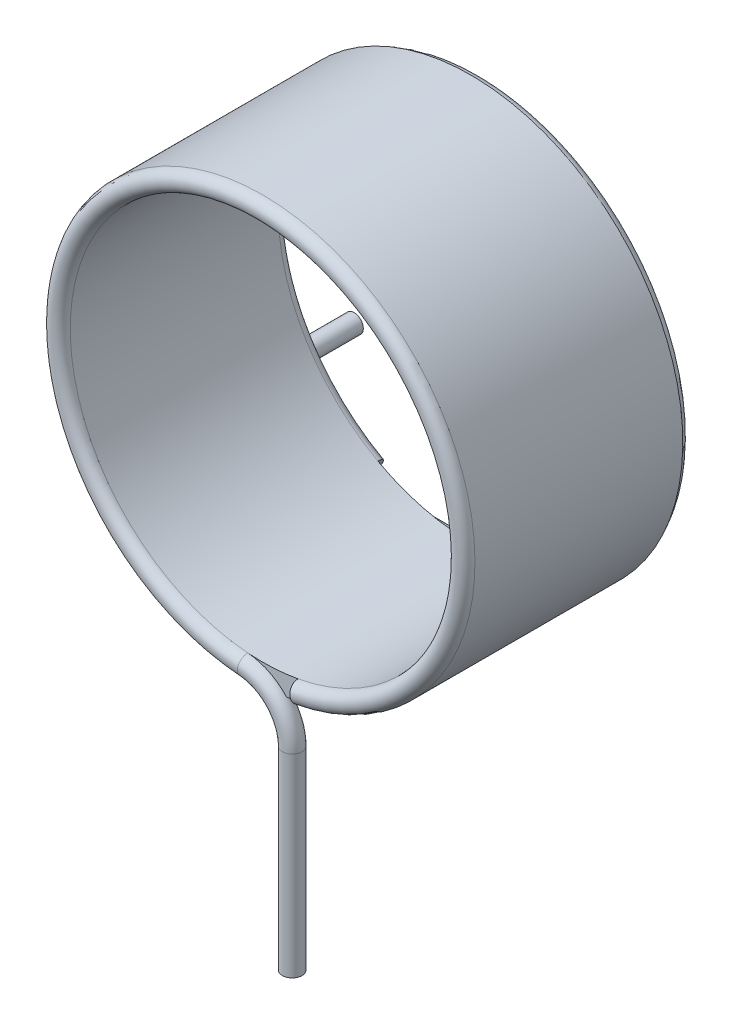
ISO-10303-21;
HEADER;
FILE_DESCRIPTION(('STEP AP214'),'2;1');
FILE_NAME('part.step','',(''),(''),'','','');
FILE_SCHEMA(('AUTOMOTIVE_DESIGN { 1 0 10303 214 1 1 1 1 }'));
ENDSEC;
DATA;
#1=APPLICATION_CONTEXT('core data for automotive mechanical design processes');
#2=APPLICATION_PROTOCOL_DEFINITION('international standard','automotive_design',2000,#1);
#3=PRODUCT_CONTEXT('',#1,'mechanical');
#4=PRODUCT('Part','Part','',(#3));
#5=PRODUCT_RELATED_PRODUCT_CATEGORY('part','',(#4));
#6=PRODUCT_DEFINITION_FORMATION('','',#4);
#7=PRODUCT_DEFINITION_CONTEXT('part definition',#1,'design');
#8=PRODUCT_DEFINITION('design','',#6,#7);
#9=PRODUCT_DEFINITION_SHAPE('','',#8);
#10=(LENGTH_UNIT() NAMED_UNIT(*) SI_UNIT(.MILLI.,.METRE.));
#11=(NAMED_UNIT(*) PLANE_ANGLE_UNIT() SI_UNIT($,.RADIAN.));
#12=(NAMED_UNIT(*) SI_UNIT($,.STERADIAN.) SOLID_ANGLE_UNIT());
#13=UNCERTAINTY_MEASURE_WITH_UNIT(LENGTH_MEASURE(1.E-05),#10,'distance_accuracy_value','');
#14=(GEOMETRIC_REPRESENTATION_CONTEXT(3) GLOBAL_UNCERTAINTY_ASSIGNED_CONTEXT((#13)) GLOBAL_UNIT_ASSIGNED_CONTEXT((#10,
#11,#12)) REPRESENTATION_CONTEXT('',''));
#15=CARTESIAN_POINT('',(0.,0.,0.));
#16=DIRECTION('',(0.,0.,1.));
#17=DIRECTION('',(1.,0.,0.));
#18=AXIS2_PLACEMENT_3D('',#15,#16,#17);
#19=CARTESIAN_POINT('',(0.,0.,0.));
#20=DIRECTION('',(0.,0.,1.));
#21=DIRECTION('',(1.,0.,0.));
#22=AXIS2_PLACEMENT_3D('',#19,#20,#21);
#23=PLANE('',#22);
#24=DIRECTION('',(1.,-1.43643142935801E-08,0.));
#25=VECTOR('',#24,1.);
#26=CARTESIAN_POINT('',(-18.4463437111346,-15.749999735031,0.));
#27=LINE('',#26,#25);
#28=CARTESIAN_POINT('',(-7.27736238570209,-15.7499998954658,0.));
#29=VERTEX_POINT('',#28);
#30=CARTESIAN_POINT('',(-2.26238028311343E-07,-15.7499999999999,0.));
#31=VERTEX_POINT('',#30);
#32=EDGE_CURVE('E160',#29,#31,#27,.T.);
#33=ORIENTED_EDGE('',*,*,#32,.F.);
#34=CARTESIAN_POINT('',(0.,0.,0.));
#35=DIRECTION('',(0.,0.,1.));
#36=DIRECTION('',(1.,0.,0.));
#37=AXIS2_PLACEMENT_3D('',#34,#35,#36);
#38=CIRCLE('',#37,17.35);
#39=CARTESIAN_POINT('',(-1.86010777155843,-17.2499999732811,0.));
#40=VERTEX_POINT('',#39);
#41=EDGE_CURVE('E39',#40,#29,#38,.T.);
#42=ORIENTED_EDGE('',*,*,#41,.F.);
#43=DIRECTION('',(1.,-1.43643142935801E-08,0.));
#44=VECTOR('',#43,1.);
#45=CARTESIAN_POINT('',(-18.4463437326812,-17.2499997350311,0.));
#46=LINE('',#45,#44);
#47=CARTESIAN_POINT('',(-2.37011188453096E-07,-17.2500000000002,0.));
#48=VERTEX_POINT('',#47);
#49=EDGE_CURVE('E54',#48,#40,#46,.F.);
#50=ORIENTED_EDGE('',*,*,#49,.F.);
#51=CARTESIAN_POINT('',(0.,0.,0.));
#52=DIRECTION('',(0.,0.,1.));
#53=DIRECTION('',(1.,0.,0.));
#54=AXIS2_PLACEMENT_3D('',#51,#52,#53);
#55=CIRCLE('',#54,17.25);
#56=CARTESIAN_POINT('',(-8.30752728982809,-15.1177872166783,0.));
#57=VERTEX_POINT('',#56);
#58=EDGE_CURVE('E166',#57,#48,#55,.F.);
#59=ORIENTED_EDGE('',*,*,#58,.F.);
#60=DIRECTION('',(-0.481595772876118,-0.876393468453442,0.));
#61=VECTOR('',#60,1.);
#62=CARTESIAN_POINT('',(-2.07715067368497E-07,1.14143583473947E-07,0.));
#63=LINE('',#62,#61);
#64=CARTESIAN_POINT('',(-7.58513363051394,-13.8031970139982,0.));
#65=VERTEX_POINT('',#64);
#66=EDGE_CURVE('E161',#65,#57,#63,.T.);
#67=ORIENTED_EDGE('',*,*,#66,.F.);
#68=CARTESIAN_POINT('',(0.,0.,0.));
#69=DIRECTION('',(0.,0.,1.));
#70=DIRECTION('',(1.,0.,0.));
#71=AXIS2_PLACEMENT_3D('',#68,#69,#70);
#72=CIRCLE('',#71,15.75);
#73=EDGE_CURVE('E169',#65,#31,#72,.T.);
#74=ORIENTED_EDGE('',*,*,#73,.T.);
#75=EDGE_LOOP('',(#33,#42,#50,#59,#67,#74));
#76=FACE_BOUND('',#75,.T.);
#77=ADVANCED_FACE('F30',(#76),#23,.F.);
#78=CARTESIAN_POINT('',(-1.11022302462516E-13,0.,17.));
#79=DIRECTION('',(0.,0.,-1.));
#80=DIRECTION('',(-1.,0.,0.));
#81=AXIS2_PLACEMENT_3D('',#78,#79,#80);
#82=CYLINDRICAL_SURFACE('',#81,17.35);
#83=CARTESIAN_POINT('',(-1.11022302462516E-13,0.,17.));
#84=DIRECTION('',(0.,0.,1.));
#85=DIRECTION('',(1.,0.,0.));
#86=AXIS2_PLACEMENT_3D('',#83,#84,#85);
#87=CIRCLE('',#86,17.35);
#88=CARTESIAN_POINT('',(1.93925118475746,-17.2412819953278,17.));
#89=VERTEX_POINT('',#88);
#90=CARTESIAN_POINT('',(3.17128633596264,-17.0577091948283,17.));
#91=VERTEX_POINT('',#90);
#92=EDGE_CURVE('E11',#89,#91,#87,.T.);
#93=ORIENTED_EDGE('',*,*,#92,.F.);
#94=CARTESIAN_POINT('',(1.93925115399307,-17.2412819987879,17.0002));
#95=CARTESIAN_POINT('',(1.93925847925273,-17.2412809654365,16.9810090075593));
#96=CARTESIAN_POINT('',(1.9384125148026,-17.2413763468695,16.9618280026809));
#97=CARTESIAN_POINT('',(1.9350366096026,-17.2417556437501,16.9236235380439));
#98=CARTESIAN_POINT('',(1.93250728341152,-17.2420394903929,16.9046000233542));
#99=CARTESIAN_POINT('',(1.92246538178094,-17.2431631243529,16.8481654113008));
#100=CARTESIAN_POINT('',(1.91249835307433,-17.2442751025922,16.8111693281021));
#101=CARTESIAN_POINT('',(1.88653535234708,-17.2471345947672,16.7394655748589));
#102=CARTESIAN_POINT('',(1.87054523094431,-17.2488814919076,16.7047557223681));
#103=CARTESIAN_POINT('',(1.83327183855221,-17.2528827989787,16.638318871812));
#104=CARTESIAN_POINT('',(1.81198400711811,-17.2551376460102,16.6065944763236));
#105=CARTESIAN_POINT('',(1.76372246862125,-17.2601390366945,16.5450804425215));
#106=CARTESIAN_POINT('',(1.73650637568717,-17.2629053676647,16.51548374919));
#107=CARTESIAN_POINT('',(1.67815772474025,-17.2686753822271,16.4604947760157));
#108=CARTESIAN_POINT('',(1.64702322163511,-17.2716791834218,16.4351045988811));
#109=CARTESIAN_POINT('',(1.56655438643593,-17.2791983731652,16.3777647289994));
#110=CARTESIAN_POINT('',(1.51548489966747,-17.2837676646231,16.3482480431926));
#111=CARTESIAN_POINT('',(1.40922752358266,-17.2927569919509,16.2978951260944));
#112=CARTESIAN_POINT('',(1.35403166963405,-17.2971767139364,16.2770762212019));
#113=CARTESIAN_POINT('',(1.21824262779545,-17.30735934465,16.2364093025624));
#114=CARTESIAN_POINT('',(1.13648382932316,-17.3129335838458,16.2204306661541));
#115=CARTESIAN_POINT('',(0.971483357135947,-17.3229794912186,16.2014452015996));
#116=CARTESIAN_POINT('',(0.888239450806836,-17.3274493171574,16.1984599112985));
#117=CARTESIAN_POINT('',(0.669774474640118,-17.3375945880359,16.2043891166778));
#118=CARTESIAN_POINT('',(0.534775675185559,-17.3422614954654,16.2219640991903));
#119=CARTESIAN_POINT('',(0.268756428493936,-17.348433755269,16.2763309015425));
#120=CARTESIAN_POINT('',(0.137747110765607,-17.3499309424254,16.3131720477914));
#121=CARTESIAN_POINT('',(-0.108965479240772,-17.350058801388,16.3962705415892));
#122=CARTESIAN_POINT('',(-0.225032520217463,-17.3489187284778,16.4414827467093));
#123=CARTESIAN_POINT('',(-0.453972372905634,-17.3444372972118,16.5393656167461));
#124=CARTESIAN_POINT('',(-0.566842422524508,-17.3410940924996,16.5920425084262));
#125=CARTESIAN_POINT('',(-0.901854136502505,-17.3279942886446,16.7569243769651));
#126=CARTESIAN_POINT('',(-1.12042960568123,-17.3151674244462,16.8759932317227));
#127=CARTESIAN_POINT('',(-1.34156923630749,-17.2980548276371,16.9966874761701));
#128=CARTESIAN_POINT('',(-1.34460383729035,-17.2978192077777,16.9983437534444));
#129=CARTESIAN_POINT('',(-1.34763835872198,-17.2975828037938,17.));
#130=B_SPLINE_CURVE_WITH_KNOTS('',3,(#94,#95,#96,#97,#98,#99,#100,#101,#102,#103,#104,#105,#106,
#107,#108,#109,#110,#111,#112,#113,#114,#115,#116,#117,#118,#119,#120,#121,#122,#123,#124,#125,
#126,#127,#128,#129),.UNSPECIFIED.,.F.,.F.,(4,2,2,2,2,2,2,2,2,2,2,2,2,2,2,2,2,4),(0.,
0.0575339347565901,0.115046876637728,0.22941928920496,0.343680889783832,0.458041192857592,
0.578490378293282,0.6989995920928,0.875497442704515,1.05234522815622,1.30142225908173,
1.55091200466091,1.95724184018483,2.36461711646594,2.73792361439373,3.11154336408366,
3.85867941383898,3.86907499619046),.UNSPECIFIED.);
#131=CARTESIAN_POINT('',(-1.34763835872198,-17.2975828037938,17.));
#132=VERTEX_POINT('',#131);
#133=EDGE_CURVE('E101',#89,#132,#130,.T.);
#134=ORIENTED_EDGE('',*,*,#133,.T.);
#135=CARTESIAN_POINT('',(-1.11022302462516E-13,0.,17.));
#136=DIRECTION('',(0.,0.,1.));
#137=DIRECTION('',(1.,0.,0.));
#138=AXIS2_PLACEMENT_3D('',#135,#136,#137);
#139=CIRCLE('',#138,17.35);
#140=EDGE_CURVE('E93',#91,#132,#139,.T.);
#141=ORIENTED_EDGE('',*,*,#140,.F.);
#142=EDGE_LOOP('',(#93,#134,#141));
#143=FACE_BOUND('',#142,.T.);
#144=CARTESIAN_POINT('',(-1.86010777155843,-17.2499999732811,0.));
#145=CARTESIAN_POINT('',(-1.86008750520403,-17.2500020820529,0.00546404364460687));
#146=CARTESIAN_POINT('',(-1.86066059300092,-17.2499403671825,0.0108964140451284));
#147=CARTESIAN_POINT('',(-1.86279211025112,-17.2497103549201,0.0214700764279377));
#148=CARTESIAN_POINT('',(-1.86433353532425,-17.2495438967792,0.0266147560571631));
#149=CARTESIAN_POINT('',(-1.86878264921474,-17.2490625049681,0.0380466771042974));
#150=CARTESIAN_POINT('',(-1.87195882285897,-17.248718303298,0.0442249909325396));
#151=CARTESIAN_POINT('',(-1.87923745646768,-17.2479268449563,0.0560403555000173));
#152=CARTESIAN_POINT('',(-1.88334663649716,-17.2474788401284,0.0616730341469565));
#153=CARTESIAN_POINT('',(-1.89811052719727,-17.2458627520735,0.0797007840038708));
#154=CARTESIAN_POINT('',(-1.91010989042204,-17.244539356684,0.0909542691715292));
#155=CARTESIAN_POINT('',(-1.93550236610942,-17.2417081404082,0.111698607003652));
#156=CARTESIAN_POINT('',(-1.94890273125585,-17.2401993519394,0.121179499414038));
#157=CARTESIAN_POINT('',(-1.98830653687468,-17.2357128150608,0.146678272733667));
#158=CARTESIAN_POINT('',(-2.0152047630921,-17.2325912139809,0.16127510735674));
#159=CARTESIAN_POINT('',(-2.07003042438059,-17.2260920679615,0.188357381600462));
#160=CARTESIAN_POINT('',(-2.09796061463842,-17.2227138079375,0.200836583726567));
#161=CARTESIAN_POINT('',(-2.15444606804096,-17.2157390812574,0.224431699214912));
#162=CARTESIAN_POINT('',(-2.18300266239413,-17.2121421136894,0.235544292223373));
#163=CARTESIAN_POINT('',(-2.24040535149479,-17.2047645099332,0.256772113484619));
#164=CARTESIAN_POINT('',(-2.2692509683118,-17.200984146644,0.266888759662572));
#165=CARTESIAN_POINT('',(-2.35553545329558,-17.1894529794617,0.295955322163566));
#166=CARTESIAN_POINT('',(-2.41329547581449,-17.1814414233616,0.313847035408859));
#167=CARTESIAN_POINT('',(-2.52926338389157,-17.1647535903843,0.347786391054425));
#168=CARTESIAN_POINT('',(-2.58747139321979,-17.1560771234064,0.363833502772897));
#169=CARTESIAN_POINT('',(-2.76262709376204,-17.1290499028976,0.409973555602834));
#170=CARTESIAN_POINT('',(-2.87996382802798,-17.109720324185,0.438020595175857));
#171=CARTESIAN_POINT('',(-3.11497856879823,-17.0684988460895,0.490310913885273));
#172=CARTESIAN_POINT('',(-3.23265647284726,-17.0466076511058,0.514555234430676));
#173=CARTESIAN_POINT('',(-3.46806682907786,-17.0002763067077,0.559704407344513));
#174=CARTESIAN_POINT('',(-3.58579919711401,-16.9758378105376,0.580611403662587));
#175=CARTESIAN_POINT('',(-3.88493754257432,-16.9104770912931,0.629657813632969));
#176=CARTESIAN_POINT('',(-4.06632912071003,-16.8677904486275,0.655589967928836));
#177=CARTESIAN_POINT('',(-4.42871525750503,-16.7762910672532,0.699090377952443));
#178=CARTESIAN_POINT('',(-4.60970943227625,-16.7274739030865,0.716652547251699));
#179=CARTESIAN_POINT('',(-4.97000816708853,-16.6239730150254,0.741594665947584));
#180=CARTESIAN_POINT('',(-5.14931658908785,-16.5693135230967,0.749015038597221));
#181=CARTESIAN_POINT('',(-5.4168262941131,-16.4829995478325,0.750353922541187));
#182=CARTESIAN_POINT('',(-5.50571512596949,-16.4535213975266,0.749170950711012));
#183=CARTESIAN_POINT('',(-5.68287993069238,-16.3931731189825,0.74297430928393));
#184=CARTESIAN_POINT('',(-5.77115601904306,-16.3623032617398,0.73796138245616));
#185=CARTESIAN_POINT('',(-5.9413054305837,-16.3012587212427,0.723823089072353));
#186=CARTESIAN_POINT('',(-6.0232302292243,-16.2711637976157,0.714978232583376));
#187=CARTESIAN_POINT('',(-6.18622471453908,-16.2098954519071,0.692395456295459));
#188=CARTESIAN_POINT('',(-6.267292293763,-16.1787199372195,0.678647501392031));
#189=CARTESIAN_POINT('',(-6.3943889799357,-16.1287577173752,0.652006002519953));
#190=CARTESIAN_POINT('',(-6.44094307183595,-16.1102214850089,0.641143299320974));
#191=CARTESIAN_POINT('',(-6.53333383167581,-16.0729750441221,0.616963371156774));
#192=CARTESIAN_POINT('',(-6.57917068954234,-16.0542648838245,0.603646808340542));
#193=CARTESIAN_POINT('',(-6.66974233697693,-16.016848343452,0.574134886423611));
#194=CARTESIAN_POINT('',(-6.71448005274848,-15.9981421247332,0.557948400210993));
#195=CARTESIAN_POINT('',(-6.80256305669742,-15.9608870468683,0.522042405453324));
#196=CARTESIAN_POINT('',(-6.84590959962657,-15.9423380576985,0.502326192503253));
#197=CARTESIAN_POINT('',(-6.91826815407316,-15.9110383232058,0.464795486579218));
#198=CARTESIAN_POINT('',(-6.94779547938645,-15.8981643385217,0.448084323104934));
#199=CARTESIAN_POINT('',(-7.00542196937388,-15.8728558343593,0.411920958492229));
#200=CARTESIAN_POINT('',(-7.03351896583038,-15.8604219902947,0.392464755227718));
#201=CARTESIAN_POINT('',(-7.08777997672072,-15.8362484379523,0.350053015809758));
#202=CARTESIAN_POINT('',(-7.11392372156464,-15.8245162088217,0.327066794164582));
#203=CARTESIAN_POINT('',(-7.16271104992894,-15.8024928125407,0.276999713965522));
#204=CARTESIAN_POINT('',(-7.18536385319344,-15.7921978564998,0.249930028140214));
#205=CARTESIAN_POINT('',(-7.21660520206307,-15.7779362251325,0.203562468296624));
#206=CARTESIAN_POINT('',(-7.22709268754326,-15.7731333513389,0.185811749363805));
#207=CARTESIAN_POINT('',(-7.24553144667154,-15.7646717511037,0.148832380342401));
#208=CARTESIAN_POINT('',(-7.25349190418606,-15.7610088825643,0.129609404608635));
#209=CARTESIAN_POINT('',(-7.26547838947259,-15.7554868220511,0.0922511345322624));
#210=CARTESIAN_POINT('',(-7.26985827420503,-15.7534655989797,0.074255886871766));
#211=CARTESIAN_POINT('',(-7.27583588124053,-15.7507052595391,0.0375296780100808));
#212=CARTESIAN_POINT('',(-7.27740439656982,-15.7499796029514,0.0187930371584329));
#213=CARTESIAN_POINT('',(-7.27736238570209,-15.7499998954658,0.));
#214=B_SPLINE_CURVE_WITH_KNOTS('',3,(#144,#145,#146,#147,#148,#149,#150,#151,#152,#153,#154,
#155,#156,#157,#158,#159,#160,#161,#162,#163,#164,#165,#166,#167,#168,#169,#170,#171,#172,#173,
#174,#175,#176,#177,#178,#179,#180,#181,#182,#183,#184,#185,#186,#187,#188,#189,#190,#191,#192,
#193,#194,#195,#196,#197,#198,#199,#200,#201,#202,#203,#204,#205,#206,#207,#208,#209,#210,#211,
#212,#213),.UNSPECIFIED.,.F.,.F.,(4,2,2,2,2,2,2,2,2,2,2,2,2,2,2,2,2,2,2,2,2,2,2,2,2,2,2,2,2,2,2,
2,2,2,4),(0.,0.0163111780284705,0.0323436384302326,0.0530909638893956,0.0739927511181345,
0.123124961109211,0.172525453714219,0.264565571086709,0.356872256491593,0.449398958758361,
0.54179196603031,0.724719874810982,0.907700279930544,1.27411246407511,1.64042412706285,
2.00649951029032,2.57064347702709,3.13519705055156,3.69749379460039,3.97839429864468,
4.25924033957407,4.52230253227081,4.78590625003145,4.93967390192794,5.09340012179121,
5.24665910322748,5.39977573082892,5.50854165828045,5.61746783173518,5.72740092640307,
5.83703851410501,5.90036411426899,5.96345686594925,6.01909129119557,6.07530041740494),.UNSPECIFIED.);
#215=EDGE_CURVE('E153',#40,#29,#214,.T.);
#216=ORIENTED_EDGE('',*,*,#215,.F.);
#217=ORIENTED_EDGE('',*,*,#41,.T.);
#218=EDGE_LOOP('',(#216,#217));
#219=FACE_BOUND('',#218,.T.);
#220=ADVANCED_FACE('F32',(#143,#219),#82,.T.);
#221=CARTESIAN_POINT('',(-1.11022302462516E-13,0.,17.));
#222=DIRECTION('',(0.,0.,1.));
#223=DIRECTION('',(1.,0.,0.));
#224=AXIS2_PLACEMENT_3D('',#221,#222,#223);
#225=PLANE('',#224);
#226=CARTESIAN_POINT('',(-1.59619413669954,-20.4879150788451,17.));
#227=DIRECTION('',(0.,0.,1.));
#228=DIRECTION('',(1.,0.,0.));
#229=AXIS2_PLACEMENT_3D('',#226,#227,#228);
#230=CIRCLE('',#229,4.8);
#231=CARTESIAN_POINT('',(-1.22336046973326,-15.7024166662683,17.));
#232=VERTEX_POINT('',#231);
#233=EDGE_CURVE('E89',#89,#232,#230,.T.);
#234=ORIENTED_EDGE('',*,*,#233,.F.);
#235=ORIENTED_EDGE('',*,*,#92,.T.);
#236=DIRECTION('',(0.182783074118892,-0.983153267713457,0.));
#237=VECTOR('',#236,1.);
#238=CARTESIAN_POINT('',(-1.11022302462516E-13,0.,17.));
#239=LINE('',#238,#237);
#240=CARTESIAN_POINT('',(2.87883341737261,-15.4846639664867,17.));
#241=VERTEX_POINT('',#240);
#242=EDGE_CURVE('E82',#241,#91,#239,.T.);
#243=ORIENTED_EDGE('',*,*,#242,.F.);
#244=CARTESIAN_POINT('',(-1.11022302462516E-13,0.,17.));
#245=DIRECTION('',(0.,0.,1.));
#246=DIRECTION('',(1.,0.,0.));
#247=AXIS2_PLACEMENT_3D('',#244,#245,#246);
#248=CIRCLE('',#247,15.75);
#249=EDGE_CURVE('E106',#232,#241,#248,.T.);
#250=ORIENTED_EDGE('',*,*,#249,.F.);
#251=EDGE_LOOP('',(#234,#235,#243,#250));
#252=FACE_BOUND('',#251,.T.);
#253=ADVANCED_FACE('F105',(#252),#225,.T.);
#254=CARTESIAN_POINT('',(-1.11022302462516E-13,0.,17.));
#255=DIRECTION('',(0.,0.,-1.));
#256=DIRECTION('',(-1.,0.,0.));
#257=AXIS2_PLACEMENT_3D('',#254,#255,#256);
#258=CYLINDRICAL_SURFACE('',#257,15.75);
#259=ORIENTED_EDGE('',*,*,#249,.T.);
#260=EDGE_CURVE('E95',#241,#232,#248,.T.);
#261=ORIENTED_EDGE('',*,*,#260,.T.);
#262=EDGE_LOOP('',(#259,#261));
#263=FACE_BOUND('',#262,.T.);
#264=ORIENTED_EDGE('',*,*,#73,.F.);
#265=EDGE_CURVE('E168',#31,#65,#72,.T.);
#266=ORIENTED_EDGE('',*,*,#265,.F.);
#267=EDGE_LOOP('',(#264,#266));
#268=FACE_BOUND('',#267,.T.);
#269=ADVANCED_FACE('F203',(#263,#268),#258,.F.);
#270=CARTESIAN_POINT('',(0.,0.,0.));
#271=DIRECTION('',(0.,0.,1.));
#272=DIRECTION('',(1.,0.,0.));
#273=AXIS2_PLACEMENT_3D('',#270,#271,#272);
#274=TOROIDAL_SURFACE('',#273,16.5,0.749999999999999);
#275=CARTESIAN_POINT('',(-7.94633046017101,-14.4604921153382,0.));
#276=DIRECTION('',(-0.876393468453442,0.481595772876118,0.));
#277=DIRECTION('',(0.,0.,1.));
#278=AXIS2_PLACEMENT_3D('',#275,#276,#277);
#279=CIRCLE('',#278,0.749999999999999);
#280=EDGE_CURVE('E179',#65,#57,#279,.T.);
#281=ORIENTED_EDGE('',*,*,#280,.T.);
#282=ORIENTED_EDGE('',*,*,#58,.T.);
#283=CARTESIAN_POINT('',(-2.37011299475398E-07,-16.5000000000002,0.));
#284=DIRECTION('',(-1.,0.,0.));
#285=DIRECTION('',(0.,0.,1.));
#286=AXIS2_PLACEMENT_3D('',#283,#284,#285);
#287=CIRCLE('',#286,0.749999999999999);
#288=EDGE_CURVE('E176',#31,#48,#287,.T.);
#289=ORIENTED_EDGE('',*,*,#288,.F.);
#290=ORIENTED_EDGE('',*,*,#265,.T.);
#291=EDGE_LOOP('',(#281,#282,#289,#290));
#292=FACE_BOUND('',#291,.T.);
#293=ADVANCED_FACE('F149',(#292),#274,.T.);
#294=CARTESIAN_POINT('',(-18.4463437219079,-16.499999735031,0.));
#295=DIRECTION('',(1.,-1.43643142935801E-08,0.));
#296=DIRECTION('',(1.43643142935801E-08,1.,0.));
#297=AXIS2_PLACEMENT_3D('',#294,#295,#296);
#298=CYLINDRICAL_SURFACE('',#297,0.749999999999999);
#299=CARTESIAN_POINT('',(-18.4463437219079,-16.499999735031,0.));
#300=DIRECTION('',(-1.,0.,0.));
#301=DIRECTION('',(0.,0.,1.));
#302=AXIS2_PLACEMENT_3D('',#299,#300,#301);
#303=CIRCLE('',#302,0.749999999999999);
#304=CARTESIAN_POINT('',(-18.4463437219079,-16.499999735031,0.749999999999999));
#305=VERTEX_POINT('',#304);
#306=EDGE_CURVE('E180',#305,#305,#303,.T.);
#307=ORIENTED_EDGE('',*,*,#306,.F.);
#308=EDGE_LOOP('',(#307));
#309=FACE_BOUND('',#308,.T.);
#310=ORIENTED_EDGE('',*,*,#288,.T.);
#311=ORIENTED_EDGE('',*,*,#49,.T.);
#312=ORIENTED_EDGE('',*,*,#215,.T.);
#313=ORIENTED_EDGE('',*,*,#32,.T.);
#314=EDGE_LOOP('',(#310,#311,#312,#313));
#315=FACE_BOUND('',#314,.T.);
#316=ADVANCED_FACE('F134',(#309,#315),#298,.T.);
#317=CARTESIAN_POINT('',(-7.94633046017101,-14.4604921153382,0.));
#318=DIRECTION('',(-0.876393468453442,0.481595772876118,0.));
#319=DIRECTION('',(0.,0.,1.));
#320=AXIS2_PLACEMENT_3D('',#317,#318,#319);
#321=PLANE('',#320);
#322=ORIENTED_EDGE('',*,*,#280,.F.);
#323=ORIENTED_EDGE('',*,*,#66,.T.);
#324=EDGE_LOOP('',(#322,#323));
#325=FACE_BOUND('',#324,.T.);
#326=ADVANCED_FACE('F130',(#325),#321,.F.);
#327=CARTESIAN_POINT('',(-19.530146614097,-16.4999997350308,0.));
#328=DIRECTION('',(1.,0.,0.));
#329=DIRECTION('',(0.,0.,-1.));
#330=AXIS2_PLACEMENT_3D('',#327,#328,#329);
#331=CYLINDRICAL_SURFACE('',#330,0.749999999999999);
#332=CARTESIAN_POINT('',(-19.530146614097,-16.4999997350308,0.));
#333=DIRECTION('',(-1.,0.,0.));
#334=DIRECTION('',(0.,0.,1.));
#335=AXIS2_PLACEMENT_3D('',#332,#333,#334);
#336=CIRCLE('',#335,0.749999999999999);
#337=CARTESIAN_POINT('',(-19.530146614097,-16.4999997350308,0.749999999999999));
#338=VERTEX_POINT('',#337);
#339=EDGE_CURVE('E184',#338,#338,#336,.T.);
#340=ORIENTED_EDGE('',*,*,#339,.F.);
#341=EDGE_LOOP('',(#340));
#342=FACE_BOUND('',#341,.T.);
#343=ORIENTED_EDGE('',*,*,#306,.T.);
#344=EDGE_LOOP('',(#343));
#345=FACE_BOUND('',#344,.T.);
#346=ADVANCED_FACE('F133',(#342,#345),#331,.T.);
#347=CARTESIAN_POINT('',(-19.530146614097,-16.4999997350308,-1.5));
#348=DIRECTION('',(0.,1.,0.));
#349=DIRECTION('',(0.,0.,1.));
#350=AXIS2_PLACEMENT_3D('',#347,#348,#349);
#351=TOROIDAL_SURFACE('',#350,1.5,0.749999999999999);
#352=CARTESIAN_POINT('',(-21.0301466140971,-16.4999997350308,-1.5));
#353=DIRECTION('',(0.,0.,-1.));
#354=DIRECTION('',(-1.,0.,0.));
#355=AXIS2_PLACEMENT_3D('',#352,#353,#354);
#356=CIRCLE('',#355,0.749999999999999);
#357=CARTESIAN_POINT('',(-21.780146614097,-16.4999997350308,-1.5));
#358=VERTEX_POINT('',#357);
#359=EDGE_CURVE('E189',#358,#358,#356,.T.);
#360=CARTESIAN_POINT('',(-19.530146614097,-16.4999997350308,-1.5));
#361=DIRECTION('',(0.,1.,0.));
#362=DIRECTION('',(0.,0.,1.));
#363=AXIS2_PLACEMENT_3D('',#360,#361,#362);
#364=CIRCLE('',#363,2.25);
#365=EDGE_CURVE('',#358,#338,#364,.T.);
#366=ORIENTED_EDGE('',*,*,#359,.F.);
#367=ORIENTED_EDGE('',*,*,#339,.T.);
#368=ORIENTED_EDGE('',*,*,#365,.T.);
#369=ORIENTED_EDGE('',*,*,#365,.F.);
#370=EDGE_LOOP('',(#366,#368,#367,#369));
#371=FACE_BOUND('',#370,.T.);
#372=ADVANCED_FACE('F138',(#371),#351,.T.);
#373=CARTESIAN_POINT('',(-21.0301466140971,-16.4999997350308,-1.5));
#374=DIRECTION('',(0.,0.,-1.));
#375=DIRECTION('',(-1.,0.,0.));
#376=AXIS2_PLACEMENT_3D('',#373,#374,#375);
#377=CYLINDRICAL_SURFACE('',#376,0.749999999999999);
#378=ORIENTED_EDGE('',*,*,#359,.T.);
#379=EDGE_LOOP('',(#378));
#380=FACE_BOUND('',#379,.T.);
#381=CARTESIAN_POINT('',(-21.0301466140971,-16.4999997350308,-11.5));
#382=DIRECTION('',(0.,0.,-1.));
#383=DIRECTION('',(-1.,0.,0.));
#384=AXIS2_PLACEMENT_3D('',#381,#382,#383);
#385=CIRCLE('',#384,0.749999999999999);
#386=CARTESIAN_POINT('',(-21.7801466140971,-16.4999997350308,-11.5));
#387=VERTEX_POINT('',#386);
#388=EDGE_CURVE('E102',#387,#387,#385,.T.);
#389=ORIENTED_EDGE('',*,*,#388,.F.);
#390=EDGE_LOOP('',(#389));
#391=FACE_BOUND('',#390,.T.);
#392=ADVANCED_FACE('F128',(#380,#391),#377,.T.);
#393=CARTESIAN_POINT('',(-21.0301466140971,-16.4999997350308,-11.5));
#394=DIRECTION('',(0.,0.,-1.));
#395=DIRECTION('',(-1.,0.,0.));
#396=AXIS2_PLACEMENT_3D('',#393,#394,#395);
#397=PLANE('',#396);
#398=ORIENTED_EDGE('',*,*,#388,.T.);
#399=EDGE_LOOP('',(#398));
#400=FACE_BOUND('',#399,.T.);
#401=ADVANCED_FACE('F120',(#400),#397,.T.);
#402=CARTESIAN_POINT('',(-1.59619413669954,-20.4879150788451,17.));
#403=DIRECTION('',(0.,0.,1.));
#404=DIRECTION('',(1.,0.,0.));
#405=AXIS2_PLACEMENT_3D('',#402,#403,#404);
#406=TOROIDAL_SURFACE('',#405,4.,0.8);
#407=CARTESIAN_POINT('',(2.40380586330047,-20.4879150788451,17.));
#408=DIRECTION('',(0.,1.,0.));
#409=DIRECTION('',(-1.,0.,0.));
#410=AXIS2_PLACEMENT_3D('',#407,#408,#409);
#411=CIRCLE('',#410,0.8);
#412=CARTESIAN_POINT('',(1.60380586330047,-20.4879150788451,17.));
#413=VERTEX_POINT('',#412);
#414=EDGE_CURVE('E313',#413,#413,#411,.T.);
#415=ORIENTED_EDGE('',*,*,#414,.T.);
#416=EDGE_LOOP('',(#415));
#417=FACE_BOUND('',#416,.T.);
#418=ORIENTED_EDGE('',*,*,#133,.F.);
#419=ORIENTED_EDGE('',*,*,#233,.T.);
#420=CARTESIAN_POINT('',(-1.28549941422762,-16.4999997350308,17.));
#421=DIRECTION('',(-0.996978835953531,0.07767368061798,0.));
#422=DIRECTION('',(-0.07767368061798,-0.996978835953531,0.));
#423=AXIS2_PLACEMENT_3D('',#420,#421,#422);
#424=CIRCLE('',#423,0.8);
#425=EDGE_CURVE('E46',#132,#232,#424,.T.);
#426=ORIENTED_EDGE('',*,*,#425,.F.);
#427=EDGE_LOOP('',(#418,#419,#426));
#428=FACE_BOUND('',#427,.T.);
#429=ADVANCED_FACE('F115',(#417,#428),#406,.T.);
#430=CARTESIAN_POINT('',(-1.11022302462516E-13,0.,17.));
#431=DIRECTION('',(0.,0.,-1.));
#432=DIRECTION('',(-1.,0.,0.));
#433=AXIS2_PLACEMENT_3D('',#430,#431,#432);
#434=TOROIDAL_SURFACE('',#433,16.55,0.8);
#435=CARTESIAN_POINT('',(3.02505987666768,-16.2711865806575,17.));
#436=DIRECTION('',(-0.983153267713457,-0.182783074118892,0.));
#437=DIRECTION('',(0.182783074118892,-0.983153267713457,0.));
#438=AXIS2_PLACEMENT_3D('',#435,#436,#437);
#439=CIRCLE('',#438,0.8);
#440=EDGE_CURVE('E85',#91,#241,#439,.T.);
#441=ORIENTED_EDGE('',*,*,#440,.F.);
#442=ORIENTED_EDGE('',*,*,#140,.T.);
#443=ORIENTED_EDGE('',*,*,#425,.T.);
#444=ORIENTED_EDGE('',*,*,#260,.F.);
#445=EDGE_LOOP('',(#441,#442,#443,#444));
#446=FACE_BOUND('',#445,.T.);
#447=ADVANCED_FACE('F92',(#446),#434,.T.);
#448=CARTESIAN_POINT('',(2.40380586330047,-20.4879150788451,17.));
#449=DIRECTION('',(0.,-1.,0.));
#450=DIRECTION('',(1.,0.,0.));
#451=AXIS2_PLACEMENT_3D('',#448,#449,#450);
#452=CYLINDRICAL_SURFACE('',#451,0.8);
#453=ORIENTED_EDGE('',*,*,#414,.F.);
#454=EDGE_LOOP('',(#453));
#455=FACE_BOUND('',#454,.T.);
#456=CARTESIAN_POINT('',(2.40380586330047,-36.3469234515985,17.));
#457=DIRECTION('',(0.,1.,0.));
#458=DIRECTION('',(-1.,0.,0.));
#459=AXIS2_PLACEMENT_3D('',#456,#457,#458);
#460=CIRCLE('',#459,0.8);
#461=CARTESIAN_POINT('',(1.60380586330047,-36.3469234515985,17.));
#462=VERTEX_POINT('',#461);
#463=EDGE_CURVE('E311',#462,#462,#460,.T.);
#464=ORIENTED_EDGE('',*,*,#463,.T.);
#465=EDGE_LOOP('',(#464));
#466=FACE_BOUND('',#465,.T.);
#467=ADVANCED_FACE('F122',(#455,#466),#452,.T.);
#468=CARTESIAN_POINT('',(3.02505987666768,-16.2711865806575,17.));
#469=DIRECTION('',(-0.983153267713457,-0.182783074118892,0.));
#470=DIRECTION('',(0.182783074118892,-0.983153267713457,0.));
#471=AXIS2_PLACEMENT_3D('',#468,#469,#470);
#472=PLANE('',#471);
#473=ORIENTED_EDGE('',*,*,#440,.T.);
#474=ORIENTED_EDGE('',*,*,#242,.T.);
#475=EDGE_LOOP('',(#473,#474));
#476=FACE_BOUND('',#475,.T.);
#477=ADVANCED_FACE('F84',(#476),#472,.T.);
#478=CARTESIAN_POINT('',(2.40380586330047,-36.3469234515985,17.));
#479=DIRECTION('',(0.,1.,0.));
#480=DIRECTION('',(-1.,0.,0.));
#481=AXIS2_PLACEMENT_3D('',#478,#479,#480);
#482=PLANE('',#481);
#483=ORIENTED_EDGE('',*,*,#463,.F.);
#484=EDGE_LOOP('',(#483));
#485=FACE_BOUND('',#484,.T.);
#486=ADVANCED_FACE('F290',(#485),#482,.F.);
#487=CLOSED_SHELL('',(#77,#220,#253,#269,#293,#316,#326,#346,#372,#392,#401,#429,#447,#467,#477,#486));
#488=MANIFOLD_SOLID_BREP('B2',#487);
#489=ADVANCED_BREP_SHAPE_REPRESENTATION('',(#18,#488),#14);
#490=SHAPE_DEFINITION_REPRESENTATION(#9,#489);
ENDSEC;
END-ISO-10303-21;
